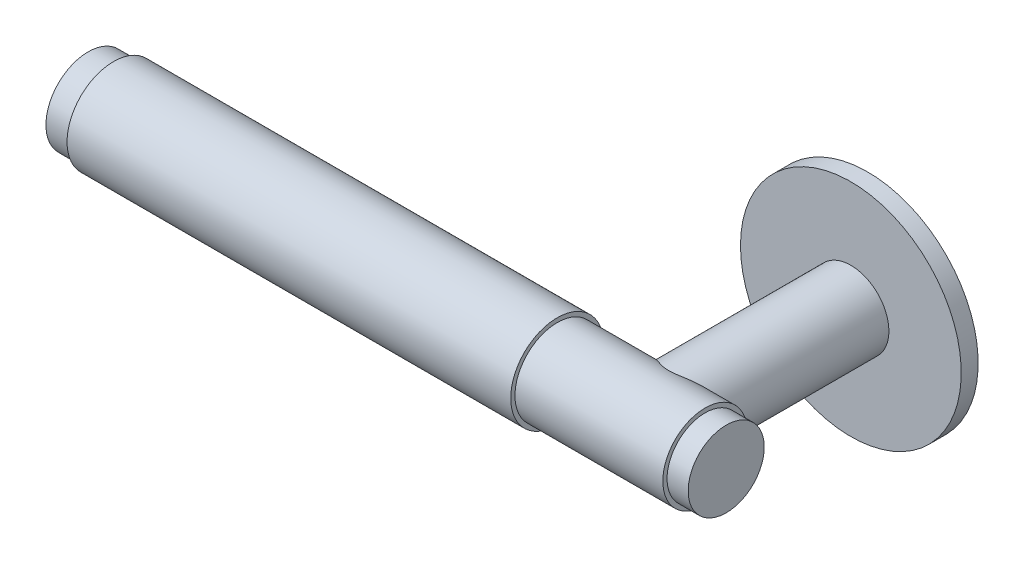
ISO-10303-21;
HEADER;
FILE_DESCRIPTION(('STEP AP214'),'2;1');
FILE_NAME('part.step','',(''),(''),'','','');
FILE_SCHEMA(('AUTOMOTIVE_DESIGN { 1 0 10303 214 1 1 1 1 }'));
ENDSEC;
DATA;
#1=APPLICATION_CONTEXT('core data for automotive mechanical design processes');
#2=APPLICATION_PROTOCOL_DEFINITION('international standard','automotive_design',2000,#1);
#3=PRODUCT_CONTEXT('',#1,'mechanical');
#4=PRODUCT('Part','Part','',(#3));
#5=PRODUCT_RELATED_PRODUCT_CATEGORY('part','',(#4));
#6=PRODUCT_DEFINITION_FORMATION('','',#4);
#7=PRODUCT_DEFINITION_CONTEXT('part definition',#1,'design');
#8=PRODUCT_DEFINITION('design','',#6,#7);
#9=PRODUCT_DEFINITION_SHAPE('','',#8);
#10=(LENGTH_UNIT() NAMED_UNIT(*) SI_UNIT(.MILLI.,.METRE.));
#11=(NAMED_UNIT(*) PLANE_ANGLE_UNIT() SI_UNIT($,.RADIAN.));
#12=(NAMED_UNIT(*) SI_UNIT($,.STERADIAN.) SOLID_ANGLE_UNIT());
#13=UNCERTAINTY_MEASURE_WITH_UNIT(LENGTH_MEASURE(1.E-05),#10,'distance_accuracy_value','');
#14=(GEOMETRIC_REPRESENTATION_CONTEXT(3) GLOBAL_UNCERTAINTY_ASSIGNED_CONTEXT((#13)) GLOBAL_UNIT_ASSIGNED_CONTEXT((#10,
#11,#12)) REPRESENTATION_CONTEXT('',''));
#15=CARTESIAN_POINT('',(0.,0.,0.));
#16=DIRECTION('',(0.,0.,1.));
#17=DIRECTION('',(1.,0.,0.));
#18=AXIS2_PLACEMENT_3D('',#15,#16,#17);
#19=CARTESIAN_POINT('',(34.0126551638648,1.77452830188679,51.4999999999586));
#20=DIRECTION('',(1.,0.,-5.79647441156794E-13));
#21=DIRECTION('',(-5.79647441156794E-13,0.,-1.));
#22=AXIS2_PLACEMENT_3D('',#19,#20,#21);
#23=CYLINDRICAL_SURFACE('',#22,10.);
#24=CARTESIAN_POINT('',(-5.98734483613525,1.77452830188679,51.4999999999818));
#25=DIRECTION('',(1.,0.,-5.79647441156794E-13));
#26=DIRECTION('',(-5.79647441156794E-13,0.,-1.));
#27=AXIS2_PLACEMENT_3D('',#24,#25,#26);
#28=CIRCLE('',#27,10.);
#29=CARTESIAN_POINT('',(-5.98734483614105,1.77452830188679,41.4999999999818));
#30=VERTEX_POINT('',#29);
#31=EDGE_CURVE('E42',#30,#30,#28,.T.);
#32=ORIENTED_EDGE('',*,*,#31,.T.);
#33=EDGE_LOOP('',(#32));
#34=FACE_BOUND('',#33,.T.);
#35=CARTESIAN_POINT('',(29.0126551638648,1.77452830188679,51.4999999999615));
#36=DIRECTION('',(1.,0.,-5.79647441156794E-13));
#37=DIRECTION('',(-5.79647441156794E-13,0.,-1.));
#38=AXIS2_PLACEMENT_3D('',#35,#36,#37);
#39=CIRCLE('',#38,10.);
#40=CARTESIAN_POINT('',(29.012655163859,1.77452830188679,41.4999999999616));
#41=VERTEX_POINT('',#40);
#42=EDGE_CURVE('E46',#41,#41,#39,.T.);
#43=ORIENTED_EDGE('',*,*,#42,.F.);
#44=EDGE_LOOP('',(#43));
#45=FACE_BOUND('',#44,.T.);
#46=CARTESIAN_POINT('',(7.01265516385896,1.77452830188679,41.4999999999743));
#47=CARTESIAN_POINT('',(7.01265697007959,1.9831196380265,41.5000017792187));
#48=CARTESIAN_POINT('',(7.01992108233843,2.19174096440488,41.5065408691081));
#49=CARTESIAN_POINT('',(7.04883569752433,2.6071895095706,41.5325519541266));
#50=CARTESIAN_POINT('',(7.07048899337,2.8140163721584,41.5520264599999));
#51=CARTESIAN_POINT('',(7.12777641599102,3.22431111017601,41.6034899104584));
#52=CARTESIAN_POINT('',(7.16342194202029,3.42777610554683,41.6354890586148));
#53=CARTESIAN_POINT('',(7.2480290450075,3.82964390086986,41.7113167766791));
#54=CARTESIAN_POINT('',(7.29699029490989,4.02804682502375,41.7551450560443));
#55=CARTESIAN_POINT('',(7.40702947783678,4.41722211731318,41.8534365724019));
#56=CARTESIAN_POINT('',(7.46802417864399,4.60803664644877,41.9078267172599));
#57=CARTESIAN_POINT('',(7.60145206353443,4.9825173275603,42.0264892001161));
#58=CARTESIAN_POINT('',(7.67388944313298,5.16618082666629,42.09076516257));
#59=CARTESIAN_POINT('',(7.82924705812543,5.52554838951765,42.2281688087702));
#60=CARTESIAN_POINT('',(7.91216638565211,5.70125314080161,42.3012957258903));
#61=CARTESIAN_POINT('',(8.08759341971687,6.04424967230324,42.4553967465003));
#62=CARTESIAN_POINT('',(8.18010327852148,6.21153955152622,42.5363726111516));
#63=CARTESIAN_POINT('',(8.41229206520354,6.60200739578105,42.7386590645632));
#64=CARTESIAN_POINT('',(8.55612811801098,6.82103990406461,42.8632303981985));
#65=CARTESIAN_POINT('',(8.85875790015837,7.24160321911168,43.1231133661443));
#66=CARTESIAN_POINT('',(9.01755260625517,7.44313288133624,43.2584257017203));
#67=CARTESIAN_POINT('',(9.3488326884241,7.82913860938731,43.5376786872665));
#68=CARTESIAN_POINT('',(9.52134849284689,8.01357469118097,43.681638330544));
#69=CARTESIAN_POINT('',(9.87848464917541,8.36503084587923,43.9755237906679));
#70=CARTESIAN_POINT('',(10.0631034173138,8.5320531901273,44.1254488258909));
#71=CARTESIAN_POINT('',(10.4481173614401,8.85267382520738,44.4324512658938));
#72=CARTESIAN_POINT('',(10.648779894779,9.00586867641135,44.5896139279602));
#73=CARTESIAN_POINT('',(11.0617244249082,9.29462097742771,44.90500851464));
#74=CARTESIAN_POINT('',(11.2740095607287,9.43017362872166,45.0632407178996));
#75=CARTESIAN_POINT('',(11.7100653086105,9.6834601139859,45.3771438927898));
#76=CARTESIAN_POINT('',(11.9338144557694,9.80122572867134,45.5328189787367));
#77=CARTESIAN_POINT('',(12.3940373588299,10.0189443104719,45.8374403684));
#78=CARTESIAN_POINT('',(12.6305028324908,10.1189086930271,45.9863909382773));
#79=CARTESIAN_POINT('',(13.1172385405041,10.3000064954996,46.2708034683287));
#80=CARTESIAN_POINT('',(13.3674569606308,10.3812053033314,46.4063112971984));
#81=CARTESIAN_POINT('',(13.8845144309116,10.5234047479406,46.6546361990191));
#82=CARTESIAN_POINT('',(14.1513370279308,10.5844250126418,46.7674752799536));
#83=CARTESIAN_POINT('',(14.6559904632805,10.6747122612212,46.939877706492));
#84=CARTESIAN_POINT('',(14.8910844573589,10.7076056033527,47.0052257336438));
#85=CARTESIAN_POINT('',(15.2501278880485,10.7429754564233,47.0764684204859));
#86=CARTESIAN_POINT('',(15.3707840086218,10.7524351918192,47.0957483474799));
#87=CARTESIAN_POINT('',(15.6135163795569,10.7664933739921,47.1245192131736));
#88=CARTESIAN_POINT('',(15.7355919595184,10.7710940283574,47.1340145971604));
#89=CARTESIAN_POINT('',(15.9808920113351,10.7753131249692,47.1427192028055));
#90=CARTESIAN_POINT('',(16.1041190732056,10.774903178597,47.1418698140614));
#91=CARTESIAN_POINT('',(16.3499371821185,10.7690465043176,47.129795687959));
#92=CARTESIAN_POINT('',(16.4725282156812,10.7635996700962,47.1185707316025));
#93=CARTESIAN_POINT('',(16.7162969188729,10.7478129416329,47.08633025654));
#94=CARTESIAN_POINT('',(16.8374717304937,10.7374644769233,47.065297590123));
#95=CARTESIAN_POINT('',(17.0774874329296,10.7121291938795,47.0144573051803));
#96=CARTESIAN_POINT('',(17.1963273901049,10.6971405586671,46.9846462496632));
#97=CARTESIAN_POINT('',(17.4814909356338,10.6554769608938,46.9030832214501));
#98=CARTESIAN_POINT('',(17.6463606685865,10.6265460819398,46.8474019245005));
#99=CARTESIAN_POINT('',(17.9699333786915,10.5606747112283,46.7241748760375));
#100=CARTESIAN_POINT('',(18.1286328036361,10.5237296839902,46.6566224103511));
#101=CARTESIAN_POINT('',(18.4405115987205,10.4423752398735,46.5124860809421));
#102=CARTESIAN_POINT('',(18.5936711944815,10.3979417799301,46.4358733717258));
#103=CARTESIAN_POINT('',(18.8943820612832,10.3021625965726,46.2761938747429));
#104=CARTESIAN_POINT('',(19.0419312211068,10.2508143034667,46.1931246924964));
#105=CARTESIAN_POINT('',(19.455266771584,10.0950327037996,45.9498440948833));
#106=CARTESIAN_POINT('',(19.714831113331,9.98260709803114,45.7841369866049));
#107=CARTESIAN_POINT('',(20.2187030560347,9.73617416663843,45.4455612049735));
#108=CARTESIAN_POINT('',(20.4629988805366,9.60215046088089,45.2726871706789));
#109=CARTESIAN_POINT('',(20.9373543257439,9.31273091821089,44.9253040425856));
#110=CARTESIAN_POINT('',(21.1674140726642,9.15733527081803,44.7507949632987));
#111=CARTESIAN_POINT('',(21.6133459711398,8.82502661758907,44.4043612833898));
#112=CARTESIAN_POINT('',(21.82922410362,8.64812277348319,44.2324356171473));
#113=CARTESIAN_POINT('',(22.2163095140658,8.29928645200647,43.9188120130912));
#114=CARTESIAN_POINT('',(22.3894887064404,8.13026465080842,43.7763089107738));
#115=CARTESIAN_POINT('',(22.7240783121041,7.77587643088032,43.4978377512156));
#116=CARTESIAN_POINT('',(22.88548800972,7.5905090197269,43.3618700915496));
#117=CARTESIAN_POINT('',(23.1949681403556,7.20367435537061,43.0988698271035));
#118=CARTESIAN_POINT('',(23.343061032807,7.00223533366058,42.9718222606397));
#119=CARTESIAN_POINT('',(23.6245447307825,6.5831456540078,42.7286924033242));
#120=CARTESIAN_POINT('',(23.7579407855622,6.36550083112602,42.6126061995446));
#121=CARTESIAN_POINT('',(23.9794241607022,5.96619927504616,42.4188528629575));
#122=CARTESIAN_POINT('',(24.0708896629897,5.78772323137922,42.3384773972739));
#123=CARTESIAN_POINT('',(24.2429026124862,5.42197015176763,42.1868197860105));
#124=CARTESIAN_POINT('',(24.3234563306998,5.23469825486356,42.1155324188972));
#125=CARTESIAN_POINT('',(24.4726477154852,4.85197856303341,41.9831575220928));
#126=CARTESIAN_POINT('',(24.5412865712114,4.65653158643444,41.9220689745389));
#127=CARTESIAN_POINT('',(24.6656191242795,4.25841549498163,41.8111923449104));
#128=CARTESIAN_POINT('',(24.7213126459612,4.05574628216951,41.7614044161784));
#129=CARTESIAN_POINT('',(24.8191561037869,3.6429160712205,41.6738115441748));
#130=CARTESIAN_POINT('',(24.8612004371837,3.43271000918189,41.6361000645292));
#131=CARTESIAN_POINT('',(24.9303407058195,3.00789334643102,41.574029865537));
#132=CARTESIAN_POINT('',(24.9574366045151,2.79328273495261,41.5496711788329));
#133=CARTESIAN_POINT('',(24.9960967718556,2.36164384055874,41.5149035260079));
#134=CARTESIAN_POINT('',(25.0076685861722,2.14461678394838,41.5044877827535));
#135=CARTESIAN_POINT('',(25.0150465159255,1.71008894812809,41.4978478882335));
#136=CARTESIAN_POINT('',(25.0108542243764,1.49258821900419,41.501622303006));
#137=CARTESIAN_POINT('',(24.9882265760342,1.08475629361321,41.5219810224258));
#138=CARTESIAN_POINT('',(24.971529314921,0.894246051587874,41.5370020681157));
#139=CARTESIAN_POINT('',(24.9262280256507,0.515736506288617,41.5777178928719));
#140=CARTESIAN_POINT('',(24.8976200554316,0.327738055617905,41.6034162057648));
#141=CARTESIAN_POINT('',(24.8289664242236,-0.0443854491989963,41.6650056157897));
#142=CARTESIAN_POINT('',(24.7889243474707,-0.228511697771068,41.7008935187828));
#143=CARTESIAN_POINT('',(24.6979794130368,-0.591957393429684,41.7822613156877));
#144=CARTESIAN_POINT('',(24.6470724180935,-0.771274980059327,41.8277448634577));
#145=CARTESIAN_POINT('',(24.5337353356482,-1.12842310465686,41.928786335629));
#146=CARTESIAN_POINT('',(24.4710569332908,-1.30611345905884,41.9845607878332));
#147=CARTESIAN_POINT('',(24.3358115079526,-1.6547690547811,42.1045774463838));
#148=CARTESIAN_POINT('',(24.2632406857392,-1.82573167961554,42.1688229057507));
#149=CARTESIAN_POINT('',(24.0318630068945,-2.32765139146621,42.3729860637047));
#150=CARTESIAN_POINT('',(23.8593366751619,-2.64780795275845,42.5243791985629));
#151=CARTESIAN_POINT('',(23.5309634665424,-3.17996657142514,42.8097678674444));
#152=CARTESIAN_POINT('',(23.38174589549,-3.39898531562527,42.9386370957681));
#153=CARTESIAN_POINT('',(23.0681513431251,-3.81909755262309,43.2070249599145));
#154=CARTESIAN_POINT('',(22.9037678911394,-4.02018332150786,43.3465481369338));
#155=CARTESIAN_POINT('',(22.5611347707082,-4.40478857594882,43.6340061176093));
#156=CARTESIAN_POINT('',(22.38285017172,-4.58826104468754,43.7819618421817));
#157=CARTESIAN_POINT('',(22.0140076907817,-4.93726883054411,44.0834688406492));
#158=CARTESIAN_POINT('',(21.8234517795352,-5.10280701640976,44.2370192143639));
#159=CARTESIAN_POINT('',(21.4262337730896,-5.41986104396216,44.5507821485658));
#160=CARTESIAN_POINT('',(21.2193021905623,-5.5709672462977,44.711066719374));
#161=CARTESIAN_POINT('',(20.793404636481,-5.85501909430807,45.031931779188));
#162=CARTESIAN_POINT('',(20.5744345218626,-5.9879584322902,45.1925123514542));
#163=CARTESIAN_POINT('',(20.124506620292,-6.23536996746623,45.5098508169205));
#164=CARTESIAN_POINT('',(19.8935765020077,-6.34988247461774,45.6666163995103));
#165=CARTESIAN_POINT('',(19.4181469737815,-6.56034958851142,45.9715256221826));
#166=CARTESIAN_POINT('',(19.173658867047,-6.65631936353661,46.1196762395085));
#167=CARTESIAN_POINT('',(18.6830273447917,-6.82387180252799,46.3920060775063));
#168=CARTESIAN_POINT('',(18.4377487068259,-6.89652169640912,46.5170644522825));
#169=CARTESIAN_POINT('',(17.9314548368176,-7.02240933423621,46.7428427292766));
#170=CARTESIAN_POINT('',(17.6704630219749,-7.07567517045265,46.8435977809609));
#171=CARTESIAN_POINT('',(17.1760853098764,-7.15285702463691,46.9935707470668));
#172=CARTESIAN_POINT('',(16.9450503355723,-7.18012417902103,47.0484846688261));
#173=CARTESIAN_POINT('',(16.5934928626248,-7.20748113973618,47.1041050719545));
#174=CARTESIAN_POINT('',(16.4755448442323,-7.21434276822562,47.1181863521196));
#175=CARTESIAN_POINT('',(16.2386997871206,-7.22341161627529,47.1368362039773));
#176=CARTESIAN_POINT('',(16.1198027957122,-7.2256190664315,47.1414052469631));
#177=CARTESIAN_POINT('',(15.8817646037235,-7.22530867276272,47.1407645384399));
#178=CARTESIAN_POINT('',(15.7626234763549,-7.22277985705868,47.1355320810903));
#179=CARTESIAN_POINT('',(15.5253162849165,-7.21305399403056,47.1155413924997));
#180=CARTESIAN_POINT('',(15.4071506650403,-7.20585492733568,47.1007790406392));
#181=CARTESIAN_POINT('',(15.0550530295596,-7.1774740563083,47.0431458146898));
#182=CARTESIAN_POINT('',(14.8237611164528,-7.14950943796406,46.9869316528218));
#183=CARTESIAN_POINT('',(14.4239017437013,-7.08590068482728,46.863581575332));
#184=CARTESIAN_POINT('',(14.2530299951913,-7.05344844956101,46.8018352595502));
#185=CARTESIAN_POINT('',(13.9179239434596,-6.97998443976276,46.6663200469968));
#186=CARTESIAN_POINT('',(13.7536941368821,-6.93896697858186,46.5925431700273));
#187=CARTESIAN_POINT('',(13.4311929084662,-6.84893990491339,46.4360127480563));
#188=CARTESIAN_POINT('',(13.2729434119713,-6.79990384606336,46.3532298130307));
#189=CARTESIAN_POINT('',(12.9623977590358,-6.69440357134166,46.1814110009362));
#190=CARTESIAN_POINT('',(12.8101038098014,-6.63793663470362,46.0923728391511));
#191=CARTESIAN_POINT('',(12.3893861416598,-6.469100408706,45.835938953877));
#192=CARTESIAN_POINT('',(12.127171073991,-6.34859463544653,45.6636700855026));
#193=CARTESIAN_POINT('',(11.6183626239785,-6.0850049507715,45.3132395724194));
#194=CARTESIAN_POINT('',(11.3717806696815,-5.94190478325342,45.1350737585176));
#195=CARTESIAN_POINT('',(10.8935465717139,-5.63328174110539,44.778396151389));
#196=CARTESIAN_POINT('',(10.6618875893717,-5.46776924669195,44.5998845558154));
#197=CARTESIAN_POINT('',(10.2135997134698,-5.11404272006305,44.2467217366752));
#198=CARTESIAN_POINT('',(9.99696397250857,-4.92583913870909,44.0720687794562));
#199=CARTESIAN_POINT('',(9.61905655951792,-4.56398868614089,43.7625119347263));
#200=CARTESIAN_POINT('',(9.45504932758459,-4.39429162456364,43.6263241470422));
#201=CARTESIAN_POINT('',(9.13849777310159,-4.03946181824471,43.3607978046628));
#202=CARTESIAN_POINT('',(8.98595380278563,-3.85432859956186,43.2314594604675));
#203=CARTESIAN_POINT('',(8.69384444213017,-3.46888609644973,42.9818280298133));
#204=CARTESIAN_POINT('',(8.55426025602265,-3.26859957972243,42.8615218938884));
#205=CARTESIAN_POINT('',(8.28943159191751,-2.85283813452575,42.6318639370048));
#206=CARTESIAN_POINT('',(8.16418325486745,-2.63736731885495,42.5225091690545));
#207=CARTESIAN_POINT('',(7.95511392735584,-2.23982549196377,42.3391032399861));
#208=CARTESIAN_POINT('',(7.86817988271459,-2.0605537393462,42.2625207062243));
#209=CARTESIAN_POINT('',(7.705264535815,-1.69354706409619,42.1185670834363));
#210=CARTESIAN_POINT('',(7.6292808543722,-1.50581399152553,42.0511939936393));
#211=CARTESIAN_POINT('',(7.48934369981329,-1.12282931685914,41.9268181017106));
#212=CARTESIAN_POINT('',(7.42537688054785,-0.927586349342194,41.8698037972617));
#213=CARTESIAN_POINT('',(7.31036390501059,-0.53043054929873,41.7671072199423));
#214=CARTESIAN_POINT('',(7.25931504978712,-0.328519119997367,41.7214225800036));
#215=CARTESIAN_POINT('',(7.18192844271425,0.0300759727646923,41.6520804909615));
#216=CARTESIAN_POINT('',(7.15260149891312,0.18561130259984,41.6257695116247));
#217=CARTESIAN_POINT('',(7.1020820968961,0.499038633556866,41.5804139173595));
#218=CARTESIAN_POINT('',(7.08088866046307,0.656930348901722,41.561368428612));
#219=CARTESIAN_POINT('',(7.04687320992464,0.974377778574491,41.530787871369));
#220=CARTESIAN_POINT('',(7.03405321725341,1.13393388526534,41.5192546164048));
#221=CARTESIAN_POINT('',(7.01694441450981,1.45383030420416,41.5038608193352));
#222=CARTESIAN_POINT('',(7.01265377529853,1.61417044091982,41.4999986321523));
#223=CARTESIAN_POINT('',(7.01265516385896,1.77452830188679,41.4999999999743));
#224=B_SPLINE_CURVE_WITH_KNOTS('',3,(#46,#47,#48,#49,#50,#51,#52,#53,#54,#55,#56,#57,#58,#59,
#60,#61,#62,#63,#64,#65,#66,#67,#68,#69,#70,#71,#72,#73,#74,#75,#76,#77,#78,#79,#80,#81,#82,#83,
#84,#85,#86,#87,#88,#89,#90,#91,#92,#93,#94,#95,#96,#97,#98,#99,#100,#101,#102,#103,#104,#105,
#106,#107,#108,#109,#110,#111,#112,#113,#114,#115,#116,#117,#118,#119,#120,#121,#122,#123,#124,
#125,#126,#127,#128,#129,#130,#131,#132,#133,#134,#135,#136,#137,#138,#139,#140,#141,#142,#143,
#144,#145,#146,#147,#148,#149,#150,#151,#152,#153,#154,#155,#156,#157,#158,#159,#160,#161,#162,
#163,#164,#165,#166,#167,#168,#169,#170,#171,#172,#173,#174,#175,#176,#177,#178,#179,#180,#181,
#182,#183,#184,#185,#186,#187,#188,#189,#190,#191,#192,#193,#194,#195,#196,#197,#198,#199,#200,
#201,#202,#203,#204,#205,#206,#207,#208,#209,#210,#211,#212,#213,#214,#215,#216,#217,#218,#219,
#220,#221,#222,#223),.UNSPECIFIED.,.T.,.F.,(4,2,2,2,2,2,2,2,2,2,2,2,2,2,2,2,2,2,2,2,2,2,2,2,2,2,
2,2,2,2,2,2,2,2,2,2,2,2,2,2,2,2,2,2,2,2,2,2,2,2,2,2,2,2,2,2,2,2,2,2,2,2,2,2,2,2,2,2,2,2,2,2,2,2,
2,2,2,2,2,2,2,2,2,2,2,2,2,2,4),(0.,0.625599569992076,1.25132060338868,1.87755246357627,
2.5037689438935,3.12579700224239,3.74805366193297,4.3702564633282,4.99259920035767,
5.86174188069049,6.73094135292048,7.60212522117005,8.47319531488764,9.36456070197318,
10.2561680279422,11.1461629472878,12.0355850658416,12.9218596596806,13.8072696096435,
14.5428179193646,14.9100463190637,15.2771078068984,15.6462499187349,16.0153998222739,
16.385197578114,16.7551403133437,17.2834681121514,17.8120956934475,18.3424540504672,
18.8730100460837,19.8550160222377,20.8377702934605,21.8205158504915,22.8028442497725,
23.6446119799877,24.4864308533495,25.3268022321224,26.1668724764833,26.8144552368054,
27.4616642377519,28.1088086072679,28.7559617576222,29.4080087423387,30.0600573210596,
30.7117888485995,31.3634545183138,31.9382646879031,32.5132652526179,33.0880857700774,
33.6631255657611,34.252034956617,34.8411711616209,36.0189002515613,36.9019217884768,
37.7853218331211,38.6710180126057,39.5565723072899,40.4624761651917,41.3686937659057,
42.2729011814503,43.1763657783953,44.0290696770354,44.8805328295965,45.5944542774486,
45.9509891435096,46.3075063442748,46.6648504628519,47.0223491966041,47.7380595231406,
48.2910346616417,48.8443781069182,49.3995847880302,49.9549953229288,50.9617880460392,
51.9693084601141,52.9763638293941,53.9829571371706,54.7996924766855,55.6164529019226,
56.4320096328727,57.2473463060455,57.8871096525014,58.5267337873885,59.1656432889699,
59.8044191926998,60.2854036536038,60.7663302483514,61.2473729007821,61.7283123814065),.UNSPECIFIED.);
#225=CARTESIAN_POINT('',(7.01265516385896,1.77452830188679,41.4999999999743));
#226=VERTEX_POINT('',#225);
#227=EDGE_CURVE('E10',#226,#226,#224,.T.);
#228=ORIENTED_EDGE('',*,*,#227,.F.);
#229=EDGE_LOOP('',(#228));
#230=FACE_BOUND('',#229,.T.);
#231=ADVANCED_FACE('F32',(#34,#45,#230),#23,.T.);
#232=CARTESIAN_POINT('',(-5.98734483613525,12.7745283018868,51.4999999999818));
#233=DIRECTION('',(-1.,0.,5.79647441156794E-13));
#234=DIRECTION('',(5.79647441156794E-13,0.,1.));
#235=AXIS2_PLACEMENT_3D('',#232,#233,#234);
#236=PLANE('',#235);
#237=ORIENTED_EDGE('',*,*,#31,.F.);
#238=EDGE_LOOP('',(#237));
#239=FACE_BOUND('',#238,.T.);
#240=CARTESIAN_POINT('',(-5.98734483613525,1.77452830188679,51.4999999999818));
#241=DIRECTION('',(1.,0.,-5.79647441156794E-13));
#242=DIRECTION('',(-5.79647441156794E-13,0.,-1.));
#243=AXIS2_PLACEMENT_3D('',#240,#241,#242);
#244=CIRCLE('',#243,11.);
#245=CARTESIAN_POINT('',(-5.98734483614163,1.77452830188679,40.4999999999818));
#246=VERTEX_POINT('',#245);
#247=EDGE_CURVE('E67',#246,#246,#244,.T.);
#248=ORIENTED_EDGE('',*,*,#247,.T.);
#249=EDGE_LOOP('',(#248));
#250=FACE_BOUND('',#249,.T.);
#251=ADVANCED_FACE('F34',(#239,#250),#236,.F.);
#252=CARTESIAN_POINT('',(29.0126551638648,11.7745283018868,51.4999999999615));
#253=DIRECTION('',(-1.,0.,5.79647441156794E-13));
#254=DIRECTION('',(5.79647441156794E-13,0.,1.));
#255=AXIS2_PLACEMENT_3D('',#252,#253,#254);
#256=PLANE('',#255);
#257=CARTESIAN_POINT('',(29.0126551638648,1.77452830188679,51.4999999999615));
#258=DIRECTION('',(1.,0.,-5.79647441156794E-13));
#259=DIRECTION('',(-5.79647441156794E-13,0.,-1.));
#260=AXIS2_PLACEMENT_3D('',#257,#258,#259);
#261=CIRCLE('',#260,9.);
#262=CARTESIAN_POINT('',(29.0126551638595,1.77452830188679,42.4999999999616));
#263=VERTEX_POINT('',#262);
#264=EDGE_CURVE('E50',#263,#263,#261,.T.);
#265=ORIENTED_EDGE('',*,*,#264,.F.);
#266=EDGE_LOOP('',(#265));
#267=FACE_BOUND('',#266,.T.);
#268=ORIENTED_EDGE('',*,*,#42,.T.);
#269=EDGE_LOOP('',(#268));
#270=FACE_BOUND('',#269,.T.);
#271=ADVANCED_FACE('F108',(#267,#270),#256,.F.);
#272=CARTESIAN_POINT('',(34.0126551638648,1.77452830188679,51.4999999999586));
#273=DIRECTION('',(1.,0.,-5.79647441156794E-13));
#274=DIRECTION('',(-5.79647441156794E-13,0.,-1.));
#275=AXIS2_PLACEMENT_3D('',#272,#273,#274);
#276=CYLINDRICAL_SURFACE('',#275,9.);
#277=CARTESIAN_POINT('',(34.0126551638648,1.77452830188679,51.4999999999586));
#278=DIRECTION('',(1.,0.,-5.79647441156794E-13));
#279=DIRECTION('',(-5.79647441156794E-13,0.,-1.));
#280=AXIS2_PLACEMENT_3D('',#277,#278,#279);
#281=CIRCLE('',#280,9.);
#282=CARTESIAN_POINT('',(34.0126551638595,1.77452830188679,42.4999999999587));
#283=VERTEX_POINT('',#282);
#284=EDGE_CURVE('E55',#283,#283,#281,.T.);
#285=ORIENTED_EDGE('',*,*,#284,.F.);
#286=EDGE_LOOP('',(#285));
#287=FACE_BOUND('',#286,.T.);
#288=ORIENTED_EDGE('',*,*,#264,.T.);
#289=EDGE_LOOP('',(#288));
#290=FACE_BOUND('',#289,.T.);
#291=ADVANCED_FACE('F115',(#287,#290),#276,.T.);
#292=CARTESIAN_POINT('',(34.0126551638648,1.77452830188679,51.4999999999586));
#293=DIRECTION('',(-1.,0.,5.79647441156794E-13));
#294=DIRECTION('',(5.79647441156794E-13,0.,1.));
#295=AXIS2_PLACEMENT_3D('',#292,#293,#294);
#296=PLANE('',#295);
#297=ORIENTED_EDGE('',*,*,#284,.T.);
#298=EDGE_LOOP('',(#297));
#299=FACE_BOUND('',#298,.T.);
#300=ADVANCED_FACE('F119',(#299),#296,.F.);
#301=CARTESIAN_POINT('',(-116.987344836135,1.77452830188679,51.5000000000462));
#302=DIRECTION('',(1.,0.,-5.79647441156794E-13));
#303=DIRECTION('',(-5.79647441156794E-13,0.,-1.));
#304=AXIS2_PLACEMENT_3D('',#301,#302,#303);
#305=PLANE('',#304);
#306=CARTESIAN_POINT('',(-116.987344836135,1.77452830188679,51.5000000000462));
#307=DIRECTION('',(1.,0.,-5.79647441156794E-13));
#308=DIRECTION('',(-5.79647441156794E-13,0.,-1.));
#309=AXIS2_PLACEMENT_3D('',#306,#307,#308);
#310=CIRCLE('',#309,10.);
#311=CARTESIAN_POINT('',(-116.987344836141,1.77452830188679,41.5000000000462));
#312=VERTEX_POINT('',#311);
#313=EDGE_CURVE('E58',#312,#312,#310,.T.);
#314=ORIENTED_EDGE('',*,*,#313,.F.);
#315=EDGE_LOOP('',(#314));
#316=FACE_BOUND('',#315,.T.);
#317=ADVANCED_FACE('F123',(#316),#305,.F.);
#318=CARTESIAN_POINT('',(34.0126551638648,1.77452830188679,51.4999999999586));
#319=DIRECTION('',(1.,0.,-5.79647441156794E-13));
#320=DIRECTION('',(-5.79647441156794E-13,0.,-1.));
#321=AXIS2_PLACEMENT_3D('',#318,#319,#320);
#322=CYLINDRICAL_SURFACE('',#321,10.);
#323=CARTESIAN_POINT('',(-110.987344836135,1.77452830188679,51.5000000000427));
#324=DIRECTION('',(1.,0.,-5.79647441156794E-13));
#325=DIRECTION('',(-5.79647441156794E-13,0.,-1.));
#326=AXIS2_PLACEMENT_3D('',#323,#324,#325);
#327=CIRCLE('',#326,10.);
#328=CARTESIAN_POINT('',(-110.987344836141,1.77452830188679,41.5000000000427));
#329=VERTEX_POINT('',#328);
#330=EDGE_CURVE('E61',#329,#329,#327,.T.);
#331=ORIENTED_EDGE('',*,*,#330,.F.);
#332=EDGE_LOOP('',(#331));
#333=FACE_BOUND('',#332,.T.);
#334=ORIENTED_EDGE('',*,*,#313,.T.);
#335=EDGE_LOOP('',(#334));
#336=FACE_BOUND('',#335,.T.);
#337=ADVANCED_FACE('F127',(#333,#336),#322,.T.);
#338=CARTESIAN_POINT('',(-110.987344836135,12.7745283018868,51.5000000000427));
#339=DIRECTION('',(1.,0.,-5.79647441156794E-13));
#340=DIRECTION('',(-5.79647441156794E-13,0.,-1.));
#341=AXIS2_PLACEMENT_3D('',#338,#339,#340);
#342=PLANE('',#341);
#343=CARTESIAN_POINT('',(-110.987344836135,1.77452830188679,51.5000000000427));
#344=DIRECTION('',(1.,0.,-5.79647441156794E-13));
#345=DIRECTION('',(-5.79647441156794E-13,0.,-1.));
#346=AXIS2_PLACEMENT_3D('',#343,#344,#345);
#347=CIRCLE('',#346,11.);
#348=CARTESIAN_POINT('',(-110.987344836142,1.77452830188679,40.5000000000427));
#349=VERTEX_POINT('',#348);
#350=EDGE_CURVE('E64',#349,#349,#347,.T.);
#351=ORIENTED_EDGE('',*,*,#350,.F.);
#352=EDGE_LOOP('',(#351));
#353=FACE_BOUND('',#352,.T.);
#354=ORIENTED_EDGE('',*,*,#330,.T.);
#355=EDGE_LOOP('',(#354));
#356=FACE_BOUND('',#355,.T.);
#357=ADVANCED_FACE('F100',(#353,#356),#342,.F.);
#358=CARTESIAN_POINT('',(34.0126551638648,1.77452830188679,51.4999999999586));
#359=DIRECTION('',(1.,0.,-5.79647441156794E-13));
#360=DIRECTION('',(-5.79647441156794E-13,0.,-1.));
#361=AXIS2_PLACEMENT_3D('',#358,#359,#360);
#362=CYLINDRICAL_SURFACE('',#361,11.);
#363=ORIENTED_EDGE('',*,*,#247,.F.);
#364=EDGE_LOOP('',(#363));
#365=FACE_BOUND('',#364,.T.);
#366=ORIENTED_EDGE('',*,*,#350,.T.);
#367=EDGE_LOOP('',(#366));
#368=FACE_BOUND('',#367,.T.);
#369=ADVANCED_FACE('F96',(#365,#368),#362,.T.);
#370=CARTESIAN_POINT('',(16.0126551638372,1.77452830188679,3.99999999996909));
#371=DIRECTION('',(5.79647441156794E-13,0.,1.));
#372=DIRECTION('',(1.,0.,-5.79647441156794E-13));
#373=AXIS2_PLACEMENT_3D('',#370,#371,#372);
#374=CYLINDRICAL_SURFACE('',#373,9.);
#375=CARTESIAN_POINT('',(16.0126551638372,1.77452830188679,3.99999999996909));
#376=DIRECTION('',(-5.79647441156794E-13,0.,-1.));
#377=DIRECTION('',(-1.,0.,5.79647441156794E-13));
#378=AXIS2_PLACEMENT_3D('',#375,#376,#377);
#379=CIRCLE('',#378,9.);
#380=CARTESIAN_POINT('',(7.01265516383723,1.77452830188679,3.9999999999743));
#381=VERTEX_POINT('',#380);
#382=EDGE_CURVE('E70',#381,#381,#379,.T.);
#383=ORIENTED_EDGE('',*,*,#382,.F.);
#384=EDGE_LOOP('',(#383));
#385=FACE_BOUND('',#384,.T.);
#386=ORIENTED_EDGE('',*,*,#227,.T.);
#387=EDGE_LOOP('',(#386));
#388=FACE_BOUND('',#387,.T.);
#389=ADVANCED_FACE('F91',(#385,#388),#374,.T.);
#390=CARTESIAN_POINT('',(16.0126551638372,1.77452830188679,3.99999999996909));
#391=DIRECTION('',(-5.79647441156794E-13,0.,-1.));
#392=DIRECTION('',(-1.,0.,5.79647441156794E-13));
#393=AXIS2_PLACEMENT_3D('',#390,#391,#392);
#394=PLANE('',#393);
#395=CARTESIAN_POINT('',(16.0126551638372,1.77452830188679,3.99999999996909));
#396=DIRECTION('',(-5.79647441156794E-13,0.,-1.));
#397=DIRECTION('',(-1.,0.,5.79647441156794E-13));
#398=AXIS2_PLACEMENT_3D('',#395,#396,#397);
#399=CIRCLE('',#398,26.125);
#400=CARTESIAN_POINT('',(-10.1123448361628,1.77452830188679,3.99999999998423));
#401=VERTEX_POINT('',#400);
#402=EDGE_CURVE('E74',#401,#401,#399,.T.);
#403=ORIENTED_EDGE('',*,*,#402,.F.);
#404=EDGE_LOOP('',(#403));
#405=FACE_BOUND('',#404,.T.);
#406=ORIENTED_EDGE('',*,*,#382,.T.);
#407=EDGE_LOOP('',(#406));
#408=FACE_BOUND('',#407,.T.);
#409=ADVANCED_FACE('F85',(#405,#408),#394,.F.);
#410=CARTESIAN_POINT('',(16.0126551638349,1.77452830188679,-3.09162417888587E-11));
#411=DIRECTION('',(5.79647441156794E-13,0.,1.));
#412=DIRECTION('',(1.,0.,-5.79647441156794E-13));
#413=AXIS2_PLACEMENT_3D('',#410,#411,#412);
#414=CYLINDRICAL_SURFACE('',#413,26.125);
#415=CARTESIAN_POINT('',(16.0126551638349,1.77452830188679,-3.09162417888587E-11));
#416=DIRECTION('',(-5.79647441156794E-13,0.,-1.));
#417=DIRECTION('',(-1.,0.,5.79647441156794E-13));
#418=AXIS2_PLACEMENT_3D('',#415,#416,#417);
#419=CIRCLE('',#418,26.125);
#420=CARTESIAN_POINT('',(-10.1123448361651,1.77452830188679,-1.57729523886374E-11));
#421=VERTEX_POINT('',#420);
#422=EDGE_CURVE('E73',#421,#421,#419,.T.);
#423=ORIENTED_EDGE('',*,*,#422,.F.);
#424=EDGE_LOOP('',(#423));
#425=FACE_BOUND('',#424,.T.);
#426=ORIENTED_EDGE('',*,*,#402,.T.);
#427=EDGE_LOOP('',(#426));
#428=FACE_BOUND('',#427,.T.);
#429=ADVANCED_FACE('F82',(#425,#428),#414,.T.);
#430=CARTESIAN_POINT('',(16.0126551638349,1.77452830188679,-3.09162417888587E-11));
#431=DIRECTION('',(-5.79647441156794E-13,0.,-1.));
#432=DIRECTION('',(-1.,0.,5.79647441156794E-13));
#433=AXIS2_PLACEMENT_3D('',#430,#431,#432);
#434=PLANE('',#433);
#435=ORIENTED_EDGE('',*,*,#422,.T.);
#436=EDGE_LOOP('',(#435));
#437=FACE_BOUND('',#436,.T.);
#438=ADVANCED_FACE('F80',(#437),#434,.T.);
#439=CLOSED_SHELL('',(#231,#251,#271,#291,#300,#317,#337,#357,#369,#389,#409,#429,#438));
#440=MANIFOLD_SOLID_BREP('B2',#439);
#441=ADVANCED_BREP_SHAPE_REPRESENTATION('',(#18,#440),#14);
#442=SHAPE_DEFINITION_REPRESENTATION(#9,#441);
ENDSEC;
END-ISO-10303-21;
